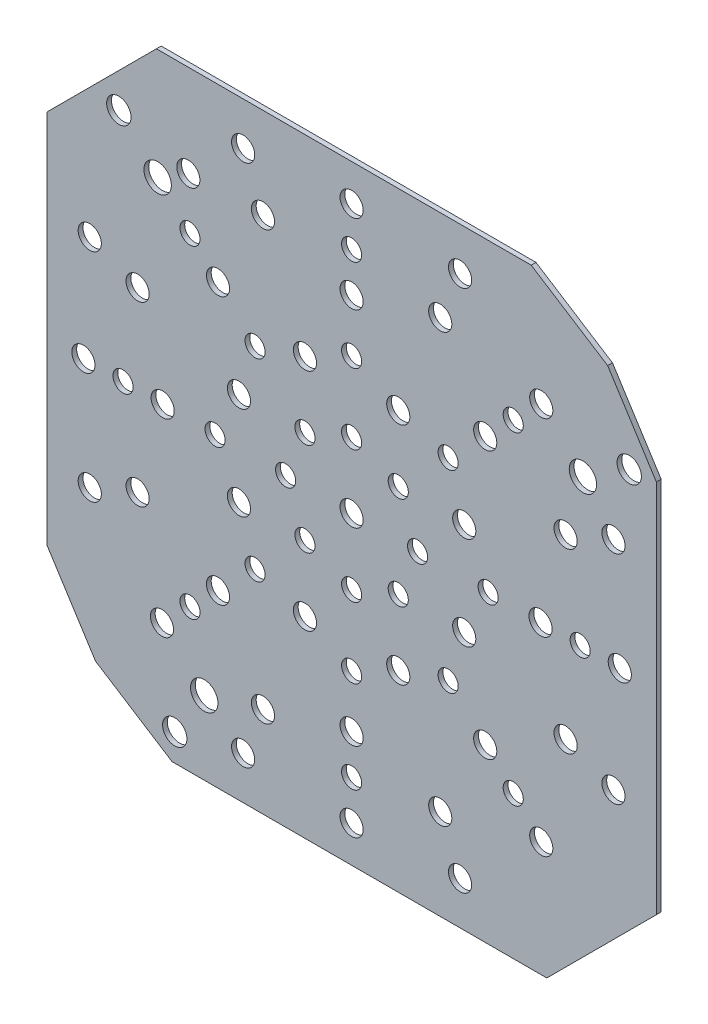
from build123d import *

# Parameters (mm, degrees)
BOSS_EXTRUDE1_DEPTH  = 0.7874
SKETCH2_W            = 65
SKETCH2_H            = 10
BOSS_EXTRUDE2_DEPTH  = 0.7874
SKETCH4_W            = 4.367421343
SKETCH4_H            = 62.323672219
BOSS_EXTRUDE3_DEPTH  = 0.7874
SKETCH5_W            = 66.579907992
SKETCH5_H            = 4.800027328
BOSS_EXTRUDE4_DEPTH  = 0.7874
SKETCH6_W            = 4.607870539
SKETCH6_H            = 65.404946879
BOSS_EXTRUDE5_DEPTH  = 0.7874
SKETCH7_R            = 51
BOSS_EXTRUDE6_DEPTH  = 0.7874
SKETCH18_R           = 1.9
WIREBONDHOLES_DEPTH  = 73.129189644
SKETCH19_R           = 1.65
PILLARHOLES_DEPTH    = 73.129189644
CIRPATTERN3_COUNT    = 8
SKETCH20_W           = 116.732730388
SKETCH20_H           = 114
SKETCH20_W_2         = 94
SKETCH20_H_2         = 94
CUT_EXTRUDE7_DEPTH   = 73.129189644
SKETCH21_W           = 1
SKETCH21_H           = 80
SKETCH21_W_2         = 80
SKETCH21_H_2         = 1
SKETCH21_W_3         = 98
SKETCH21_H_3         = 98
BOSS_EXTRUDE7_DEPTH  = 0.7874
SKETCH22_R           = 2
SKETCH22_R_2         = 2.25
MOUNTING_HOLES_DEPTH = 71.715062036
SKETCH23_W           = 120
SKETCH23_H           = 120
CUT_EXTRUDE8_DEPTH   = 71.715062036


with BuildPart() as part:
    # Sketch1 → Boss-Extrude1 (new body)
    with BuildSketch(Plane(origin=(0, 0, -1.6), x_dir=(-1, 0, 0), z_dir=(0, 0, -1))):
        with BuildLine():
            Line((29, 46.5), (29, 42.5))
            ThreePointArc((29, 42.5), (28.853553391, 42.146446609), (28.5, 42))
            Line((28.5, 42), (26.5, 42))
            ThreePointArc((26.5, 42), (26.146446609, 42.146446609), (26, 42.5))
            Line((26, 42.5), (26, 46.5))
            ThreePointArc((26, 46.5), (25.853553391, 46.853553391), (25.5, 47))
            Line((25.5, 47), (-7.5, 47))
            ThreePointArc((-7.5, 47), (-7.853553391, 46.853553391), (-8, 46.5))
            Line((-8, 46.5), (-8, 42.5))
            ThreePointArc((-8, 42.5), (-8.146446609, 42.146446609), (-8.5, 42))
            Line((-8.5, 42), (-13.5, 42))
            ThreePointArc((-13.5, 42), (-13.853553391, 42.146446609), (-14, 42.5))
            Line((-14, 42.5), (-14, 46.5))
            ThreePointArc((-14, 46.5), (-14.146446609, 46.853553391), (-14.5, 47))
            Line((-14.5, 47), (-25.5, 47))
            ThreePointArc((-25.5, 47), (-25.853553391, 46.853553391), (-26, 46.5))
            Line((-26, 46.5), (-26, 42.5))
            ThreePointArc((-26, 42.5), (-26.146446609, 42.146446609), (-26.5, 42))
            Line((-26.5, 42), (-28.5, 42))
            ThreePointArc((-28.5, 42), (-28.853553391, 42.146446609), (-29, 42.5))
            Line((-29, 42.5), (-29, 46.5))
            ThreePointArc((-29, 46.5), (-29.146446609, 46.853553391), (-29.5, 47))
            Line((-29.5, 47), (-46.5, 47))
            ThreePointArc((-46.5, 47), (-46.853553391, 46.853553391), (-47, 46.5))
            Line((-47, 46.5), (-47, 29.5))
            ThreePointArc((-47, 29.5), (-46.853553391, 29.146446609), (-46.5, 29))
            Line((-46.5, 29), (-45.5, 29))
            ThreePointArc((-45.5, 29), (-45.146446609, 28.853553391), (-45, 28.5))
            Line((-45, 28.5), (-45, -28.5))
            ThreePointArc((-45, -28.5), (-45.146446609, -28.853553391), (-45.5, -29))
            Line((-45.5, -29), (-46.5, -29))
            ThreePointArc((-46.5, -29), (-46.853553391, -29.146446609), (-47, -29.5))
            Line((-47, -29.5), (-47, -46.5))
            ThreePointArc((-47, -46.5), (-46.853553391, -46.853553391), (-46.5, -47))
            Line((-46.5, -47), (-29.5, -47))
            ThreePointArc((-29.5, -47), (-29.146446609, -46.853553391), (-29, -46.5))
            Line((-29, -46.5), (-29, -45.5))
            ThreePointArc((-29, -45.5), (-28.853553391, -45.146446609), (-28.5, -45))
            Line((-28.5, -45), (28.5, -45))
            ThreePointArc((28.5, -45), (28.853553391, -45.146446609), (29, -45.5))
            Line((29, -45.5), (29, -46.5))
            ThreePointArc((29, -46.5), (29.146446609, -46.853553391), (29.5, -47))
            Line((29.5, -47), (46.5, -47))
            ThreePointArc((46.5, -47), (46.853553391, -46.853553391), (47, -46.5))
            Line((47, -46.5), (47, -29.5))
            ThreePointArc((47, -29.5), (46.853553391, -29.146446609), (46.5, -29))
            Line((46.5, -29), (45.5, -29))
            ThreePointArc((45.5, -29), (45.146446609, -28.853553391), (45, -28.5))
            Line((45, -28.5), (45, 28.5))
            ThreePointArc((45, 28.5), (45.146446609, 28.853553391), (45.5, 29))
            Line((45.5, 29), (46.5, 29))
            ThreePointArc((46.5, 29), (46.853553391, 29.146446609), (47, 29.5))
            Line((47, 29.5), (47, 46.5))
            ThreePointArc((47, 46.5), (46.853553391, 46.853553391), (46.5, 47))
            Line((46.5, 47), (29.5, 47))
            ThreePointArc((29.5, 47), (29.146446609, 46.853553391), (29, 46.5))
        make_face()
    extrude(amount=-BOSS_EXTRUDE1_DEPTH)

    # Sketch2 → Boss-Extrude2 (add)
    with BuildSketch(Plane(origin=(0, 0, -1.6), x_dir=(-1, 0, 0), z_dir=(0, 0, -1))):
        with Locations((-0.966708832, 42)):
            Rectangle(SKETCH2_W, SKETCH2_H)
    extrude(amount=-BOSS_EXTRUDE2_DEPTH)

    # Sketch4 → Boss-Extrude3 (add)
    with BuildSketch(Plane.XY.offset(-0.8126)):
        with Locations((44.816289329, -0.5080402)):
            Rectangle(SKETCH4_W, SKETCH4_H)
    extrude(amount=-BOSS_EXTRUDE3_DEPTH)

    # Sketch5 → Boss-Extrude4 (add)
    with BuildSketch(Plane.XY.offset(-0.8126)):
        with Locations((-0.614332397, -44.599986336)):
            Rectangle(SKETCH5_W, SKETCH5_H)
    extrude(amount=-BOSS_EXTRUDE4_DEPTH)

    # Sketch6 → Boss-Extrude5 (add)
    with BuildSketch(Plane.XY.offset(-0.8126)):
        with Locations((-44.69606473, 0.14739994)):
            Rectangle(SKETCH6_W, SKETCH6_H)
    extrude(amount=-BOSS_EXTRUDE5_DEPTH)

    # Sketch7 → Boss-Extrude6 (add)
    with BuildSketch(Plane.XY.offset(-0.8126)):
        Circle(SKETCH7_R)
    extrude(amount=-BOSS_EXTRUDE6_DEPTH)

    # Sketch18 → WirebondHoles (cut, through all)
    with BuildSketch(Plane.XY.offset(-0.8126)):
        Circle(SKETCH18_R)
        with Locations((-35.107422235, 14.54197043)):
            Circle(SKETCH18_R)
        with Locations((-7.653668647, 18.47759065)):
            Circle(SKETCH18_R)
        with Locations((7.653668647, 18.47759065)):
            Circle(SKETCH18_R)
        with Locations((18.47759065, 7.653668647)):
            Circle(SKETCH18_R)
        with Locations((18.47759065, -7.653668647)):
            Circle(SKETCH18_R)
        with Locations((7.653668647, -18.47759065)):
            Circle(SKETCH18_R)
        with Locations((-7.653668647, -18.47759065)):
            Circle(SKETCH18_R)
        with Locations((-18.47759065, -7.653668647)):
            Circle(SKETCH18_R)
        with Locations((-44, 0)):
            Circle(SKETCH18_R)
        with Locations((-21.920310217, 21.920310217)):
            Circle(SKETCH18_R)
        with Locations((0, 44)):
            Circle(SKETCH18_R)
        with Locations((31.112698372, 31.112698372)):
            Circle(SKETCH18_R)
        with Locations((44, 0)):
            Circle(SKETCH18_R)
        with Locations((31.112698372, -31.112698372)):
            Circle(SKETCH18_R)
        with Locations((0, -44)):
            Circle(SKETCH18_R)
        with Locations((-31.112698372, -31.112698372)):
            Circle(SKETCH18_R)
        with Locations((17.794779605, 42.960398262)):
            Circle(SKETCH18_R)
        with Locations((42.960398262, -17.794779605)):
            Circle(SKETCH18_R)
        with Locations((-17.794779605, -42.960398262)):
            Circle(SKETCH18_R)
        with Locations((-26.785502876, 34.907546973)):
            Circle(SKETCH18_R)
        with Locations((-42.960398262, -17.794779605)):
            Circle(SKETCH18_R)
        with Locations((17.794779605, -42.960398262)):
            Circle(SKETCH18_R)
        with Locations((42.960398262, 17.794779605)):
            Circle(SKETCH18_R)
        with Locations((-17.794779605, 42.960398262)):
            Circle(SKETCH18_R)
        with Locations((-21.920310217, -21.920310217)):
            Circle(SKETCH18_R)
        with Locations((0, -31)):
            Circle(SKETCH18_R)
        with Locations((21.920310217, -21.920310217)):
            Circle(SKETCH18_R)
        with Locations((31, 0)):
            Circle(SKETCH18_R)
        with Locations((21.920310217, 21.920310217)):
            Circle(SKETCH18_R)
        with Locations((0, 31)):
            Circle(SKETCH18_R)
        with Locations((-42.960398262, 17.794779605)):
            Circle(SKETCH18_R)
        with Locations((-35.107422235, -14.54197043)):
            Circle(SKETCH18_R)
        with Locations((-14.54197043, -35.107422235)):
            Circle(SKETCH18_R)
        with Locations((14.54197043, -35.107422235)):
            Circle(SKETCH18_R)
        with Locations((35.107422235, -14.54197043)):
            Circle(SKETCH18_R)
        with Locations((35.107422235, 14.54197043)):
            Circle(SKETCH18_R)
        with Locations((14.54197043, 35.107422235)):
            Circle(SKETCH18_R)
        with Locations((-14.54197043, 35.107422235)):
            Circle(SKETCH18_R)
        with Locations((-31, 0)):
            Circle(SKETCH18_R)
        with Locations((-18.47759065, 7.653668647)):
            Circle(SKETCH18_R)
    extrude(amount=-WIREBONDHOLES_DEPTH, mode=Mode.SUBTRACT)

    # Sketch19 → PillarHoles (cut, through all)
    with BuildSketch(Plane.XY.offset(-0.8126)):
        with Locations((10.823922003, 0)):
            Circle(SKETCH19_R)
        with Locations((15.83908069, 15.83908069)):
            Circle(SKETCH19_R)
        with Locations((0, 37.5)):
            Circle(SKETCH19_R)
    pillarholes = extrude(amount=-PILLARHOLES_DEPTH, mode=Mode.SUBTRACT)

    # CirPattern3: PillarHoles ×8 about axis
    cirpattern3_axis = Axis((0, 0, 0), (0, 0, 1))
    for i in range(1, CIRPATTERN3_COUNT):
        add(pillarholes.rotate(cirpattern3_axis, i * 360 / CIRPATTERN3_COUNT), mode=Mode.SUBTRACT)

    # Sketch20 → Cut-Extrude7 (cut, through all)
    with BuildSketch(Plane(origin=(0, 0, -1.6), x_dir=(-1, 0, 0), z_dir=(0, 0, -1))):
        Rectangle(SKETCH20_W, SKETCH20_H)
        Rectangle(SKETCH20_W_2, SKETCH20_H_2, mode=Mode.SUBTRACT)
    extrude(amount=-CUT_EXTRUDE7_DEPTH, mode=Mode.SUBTRACT)

    # Sketch21 → Boss-Extrude7 (add)
    # profile 1 of 5: a face of its own
    with BuildSketch(Plane(origin=(0, 0, -1.6), x_dir=(-1, 0, 0), z_dir=(0, 0, -1))):
        with Locations((49.5, 0)):
            Rectangle(SKETCH21_W, SKETCH21_H)
    # profile 2 of 5: a face of its own
    with BuildSketch(Plane(origin=(0, 0, -1.6), x_dir=(-1, 0, 0), z_dir=(0, 0, -1))):
        with Locations((0, 49.5)):
            Rectangle(SKETCH21_W_2, SKETCH21_H_2)
    # profile 3 of 5: a face of its own
    with BuildSketch(Plane(origin=(0, 0, -1.6), x_dir=(-1, 0, 0), z_dir=(0, 0, -1))):
        with Locations((-49.5, 0)):
            Rectangle(SKETCH21_W, SKETCH21_H)
    # profile 4 of 5: a face of its own
    with BuildSketch(Plane(origin=(0, 0, -1.6), x_dir=(-1, 0, 0), z_dir=(0, 0, -1))):
        with Locations((0, -49.5)):
            Rectangle(SKETCH21_W_2, SKETCH21_H_2)
    # profile 5 of 5: a face of its own
    with BuildSketch(Plane(origin=(0, 0, -1.6), x_dir=(-1, 0, 0), z_dir=(0, 0, -1))):
        Rectangle(SKETCH21_W_3, SKETCH21_H_3)
        with BuildLine():
            Line((-47, -37), (-47, 37))
            ThreePointArc((-47, 37), (-44.071067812, 44.071067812), (-37, 47))
            Line((-37, 47), (37, 47))
            ThreePointArc((37, 47), (44.071067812, 44.071067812), (47, 37))
            Line((47, 37), (47, -37))
            ThreePointArc((47, -37), (44.071067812, -44.071067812), (37, -47))
            Line((37, -47), (-37, -47))
            ThreePointArc((-37, -47), (-44.071067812, -44.071067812), (-47, -37))
        make_face(mode=Mode.SUBTRACT)
    extrude(amount=-BOSS_EXTRUDE7_DEPTH)

    # Sketch22 → Mounting Holes (cut, through all)
    with BuildSketch(Plane(origin=(0, 0, -1.6), x_dir=(-1, 0, 0), z_dir=(0, 0, -1))):
        with Locations((38.183766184, 38.183766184)):
            Circle(SKETCH22_R)
        with Locations((-45.543138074, 29.014178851)):
            Circle(SKETCH22_R)
        with Locations((29.014178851, -45.543138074)):
            Circle(SKETCH22_R)
        with Locations((-37.952615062, 24.178482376)):
            Circle(SKETCH22_R_2)
        with Locations((31.819805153, 31.819805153)):
            Circle(SKETCH22_R_2)
        with Locations((24.178482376, -37.952615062)):
            Circle(SKETCH22_R_2)
    extrude(amount=-MOUNTING_HOLES_DEPTH, mode=Mode.SUBTRACT)

    # Sketch23 → Cut-Extrude8 (cut, through all)
    with BuildSketch(Plane(origin=(0, 0, -1.6), x_dir=(-1, 0, 0), z_dir=(0, 0, -1))):
        Rectangle(SKETCH23_W, SKETCH23_H)
        Polygon((-50, -32.024386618), (-32.024386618, -50), (29.462942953, -50), (42.007949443, -42.007949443), (50, -29.462942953), (50, 32.024386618), (32.024386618, 50), (-29.462942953, 50), (-42.007949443, 42.007949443), (-50, 29.462942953), align=None, mode=Mode.SUBTRACT)
    extrude(amount=-CUT_EXTRUDE8_DEPTH, mode=Mode.SUBTRACT)


solid = part.part
